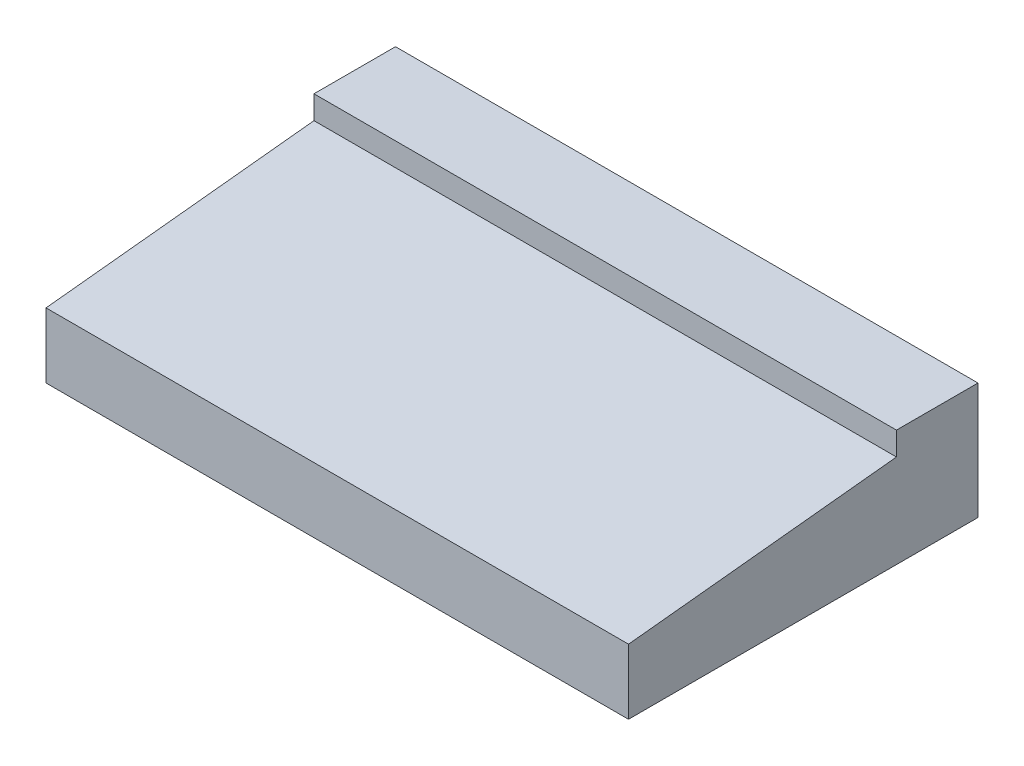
ISO-10303-21;
HEADER;
FILE_DESCRIPTION(('STEP AP214'),'2;1');
FILE_NAME('part.step','',(''),(''),'','','');
FILE_SCHEMA(('AUTOMOTIVE_DESIGN { 1 0 10303 214 1 1 1 1 }'));
ENDSEC;
DATA;
#1=APPLICATION_CONTEXT('core data for automotive mechanical design processes');
#2=APPLICATION_PROTOCOL_DEFINITION('international standard','automotive_design',2000,#1);
#3=PRODUCT_CONTEXT('',#1,'mechanical');
#4=PRODUCT('Part','Part','',(#3));
#5=PRODUCT_RELATED_PRODUCT_CATEGORY('part','',(#4));
#6=PRODUCT_DEFINITION_FORMATION('','',#4);
#7=PRODUCT_DEFINITION_CONTEXT('part definition',#1,'design');
#8=PRODUCT_DEFINITION('design','',#6,#7);
#9=PRODUCT_DEFINITION_SHAPE('','',#8);
#10=(LENGTH_UNIT() NAMED_UNIT(*) SI_UNIT(.MILLI.,.METRE.));
#11=(NAMED_UNIT(*) PLANE_ANGLE_UNIT() SI_UNIT($,.RADIAN.));
#12=(NAMED_UNIT(*) SI_UNIT($,.STERADIAN.) SOLID_ANGLE_UNIT());
#13=UNCERTAINTY_MEASURE_WITH_UNIT(LENGTH_MEASURE(1.E-05),#10,'distance_accuracy_value','');
#14=(GEOMETRIC_REPRESENTATION_CONTEXT(3) GLOBAL_UNCERTAINTY_ASSIGNED_CONTEXT((#13)) GLOBAL_UNIT_ASSIGNED_CONTEXT((#10,
#11,#12)) REPRESENTATION_CONTEXT('',''));
#15=CARTESIAN_POINT('',(0.,0.,0.));
#16=DIRECTION('',(0.,0.,1.));
#17=DIRECTION('',(1.,0.,0.));
#18=AXIS2_PLACEMENT_3D('',#15,#16,#17);
#19=CARTESIAN_POINT('',(50.,0.,-30.));
#20=DIRECTION('',(0.,1.,0.));
#21=DIRECTION('',(0.,0.,1.));
#22=AXIS2_PLACEMENT_3D('',#19,#20,#21);
#23=PLANE('',#22);
#24=DIRECTION('',(0.,0.,-1.));
#25=VECTOR('',#24,1.);
#26=CARTESIAN_POINT('',(0.,0.,-30.));
#27=LINE('',#26,#25);
#28=CARTESIAN_POINT('',(0.,0.,0.));
#29=VERTEX_POINT('',#28);
#30=CARTESIAN_POINT('',(0.,0.,-30.));
#31=VERTEX_POINT('',#30);
#32=EDGE_CURVE('E82',#29,#31,#27,.T.);
#33=ORIENTED_EDGE('',*,*,#32,.T.);
#34=DIRECTION('',(-1.,0.,0.));
#35=VECTOR('',#34,1.);
#36=CARTESIAN_POINT('',(50.,0.,-30.));
#37=LINE('',#36,#35);
#38=CARTESIAN_POINT('',(50.,0.,-30.));
#39=VERTEX_POINT('',#38);
#40=EDGE_CURVE('E11',#39,#31,#37,.T.);
#41=ORIENTED_EDGE('',*,*,#40,.F.);
#42=DIRECTION('',(0.,0.,-1.));
#43=VECTOR('',#42,1.);
#44=CARTESIAN_POINT('',(50.,0.,-30.));
#45=LINE('',#44,#43);
#46=CARTESIAN_POINT('',(50.,0.,0.));
#47=VERTEX_POINT('',#46);
#48=EDGE_CURVE('E105',#47,#39,#45,.T.);
#49=ORIENTED_EDGE('',*,*,#48,.F.);
#50=DIRECTION('',(-1.,0.,0.));
#51=VECTOR('',#50,1.);
#52=CARTESIAN_POINT('',(50.,0.,0.));
#53=LINE('',#52,#51);
#54=EDGE_CURVE('E95',#47,#29,#53,.T.);
#55=ORIENTED_EDGE('',*,*,#54,.T.);
#56=EDGE_LOOP('',(#33,#41,#49,#55));
#57=FACE_BOUND('',#56,.T.);
#58=ADVANCED_FACE('F26',(#57),#23,.F.);
#59=CARTESIAN_POINT('',(50.,10.,-30.));
#60=DIRECTION('',(0.,0.,1.));
#61=DIRECTION('',(1.,0.,0.));
#62=AXIS2_PLACEMENT_3D('',#59,#60,#61);
#63=PLANE('',#62);
#64=DIRECTION('',(0.,1.,0.));
#65=VECTOR('',#64,1.);
#66=CARTESIAN_POINT('',(0.,10.,-30.));
#67=LINE('',#66,#65);
#68=CARTESIAN_POINT('',(0.,10.,-30.));
#69=VERTEX_POINT('',#68);
#70=EDGE_CURVE('E78',#31,#69,#67,.T.);
#71=ORIENTED_EDGE('',*,*,#70,.T.);
#72=DIRECTION('',(-1.,0.,0.));
#73=VECTOR('',#72,1.);
#74=CARTESIAN_POINT('',(50.,10.,-30.));
#75=LINE('',#74,#73);
#76=CARTESIAN_POINT('',(50.,10.,-30.));
#77=VERTEX_POINT('',#76);
#78=EDGE_CURVE('E33',#77,#69,#75,.T.);
#79=ORIENTED_EDGE('',*,*,#78,.F.);
#80=DIRECTION('',(0.,1.,0.));
#81=VECTOR('',#80,1.);
#82=CARTESIAN_POINT('',(50.,10.,-30.));
#83=LINE('',#82,#81);
#84=EDGE_CURVE('E91',#39,#77,#83,.T.);
#85=ORIENTED_EDGE('',*,*,#84,.F.);
#86=ORIENTED_EDGE('',*,*,#40,.T.);
#87=EDGE_LOOP('',(#71,#79,#85,#86));
#88=FACE_BOUND('',#87,.T.);
#89=ADVANCED_FACE('F90',(#88),#63,.F.);
#90=CARTESIAN_POINT('',(50.,10.,-23.));
#91=DIRECTION('',(0.,-1.,0.));
#92=DIRECTION('',(0.,0.,-1.));
#93=AXIS2_PLACEMENT_3D('',#90,#91,#92);
#94=PLANE('',#93);
#95=DIRECTION('',(0.,0.,1.));
#96=VECTOR('',#95,1.);
#97=CARTESIAN_POINT('',(0.,10.,-23.));
#98=LINE('',#97,#96);
#99=CARTESIAN_POINT('',(0.,10.,-23.));
#100=VERTEX_POINT('',#99);
#101=EDGE_CURVE('E84',#69,#100,#98,.T.);
#102=ORIENTED_EDGE('',*,*,#101,.T.);
#103=DIRECTION('',(-1.,0.,0.));
#104=VECTOR('',#103,1.);
#105=CARTESIAN_POINT('',(50.,10.,-23.));
#106=LINE('',#105,#104);
#107=CARTESIAN_POINT('',(50.,10.,-23.));
#108=VERTEX_POINT('',#107);
#109=EDGE_CURVE('E121',#108,#100,#106,.T.);
#110=ORIENTED_EDGE('',*,*,#109,.F.);
#111=DIRECTION('',(0.,0.,1.));
#112=VECTOR('',#111,1.);
#113=CARTESIAN_POINT('',(50.,10.,-23.));
#114=LINE('',#113,#112);
#115=EDGE_CURVE('E108',#77,#108,#114,.T.);
#116=ORIENTED_EDGE('',*,*,#115,.F.);
#117=ORIENTED_EDGE('',*,*,#78,.T.);
#118=EDGE_LOOP('',(#102,#110,#116,#117));
#119=FACE_BOUND('',#118,.T.);
#120=ADVANCED_FACE('F125',(#119),#94,.F.);
#121=CARTESIAN_POINT('',(50.,8.,-23.));
#122=DIRECTION('',(0.,0.,-1.));
#123=DIRECTION('',(-1.,0.,0.));
#124=AXIS2_PLACEMENT_3D('',#121,#122,#123);
#125=PLANE('',#124);
#126=DIRECTION('',(0.,-1.,0.));
#127=VECTOR('',#126,1.);
#128=CARTESIAN_POINT('',(0.,8.,-23.));
#129=LINE('',#128,#127);
#130=CARTESIAN_POINT('',(0.,8.,-23.));
#131=VERTEX_POINT('',#130);
#132=EDGE_CURVE('E99',#100,#131,#129,.T.);
#133=ORIENTED_EDGE('',*,*,#132,.T.);
#134=DIRECTION('',(-1.,0.,0.));
#135=VECTOR('',#134,1.);
#136=CARTESIAN_POINT('',(50.,8.,-23.));
#137=LINE('',#136,#135);
#138=CARTESIAN_POINT('',(50.,8.,-23.));
#139=VERTEX_POINT('',#138);
#140=EDGE_CURVE('E118',#139,#131,#137,.T.);
#141=ORIENTED_EDGE('',*,*,#140,.F.);
#142=DIRECTION('',(0.,-1.,0.));
#143=VECTOR('',#142,1.);
#144=CARTESIAN_POINT('',(50.,8.,-23.));
#145=LINE('',#144,#143);
#146=EDGE_CURVE('E110',#108,#139,#145,.T.);
#147=ORIENTED_EDGE('',*,*,#146,.F.);
#148=ORIENTED_EDGE('',*,*,#109,.T.);
#149=EDGE_LOOP('',(#133,#141,#147,#148));
#150=FACE_BOUND('',#149,.T.);
#151=ADVANCED_FACE('F131',(#150),#125,.F.);
#152=CARTESIAN_POINT('',(50.,8.,-23.));
#153=DIRECTION('',(0.,-0.994521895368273,-0.104528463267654));
#154=DIRECTION('',(0.,0.104528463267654,-0.994521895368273));
#155=AXIS2_PLACEMENT_3D('',#152,#153,#154);
#156=PLANE('',#155);
#157=DIRECTION('',(0.,-0.104528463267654,0.994521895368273));
#158=VECTOR('',#157,1.);
#159=CARTESIAN_POINT('',(0.,8.,-23.));
#160=LINE('',#159,#158);
#161=CARTESIAN_POINT('',(0.,5.58290395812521,-0.00286733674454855));
#162=VERTEX_POINT('',#161);
#163=EDGE_CURVE('E101',#131,#162,#160,.T.);
#164=ORIENTED_EDGE('',*,*,#163,.T.);
#165=DIRECTION('',(-1.,0.,0.));
#166=VECTOR('',#165,1.);
#167=CARTESIAN_POINT('',(50.,5.58290395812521,-0.00286733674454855));
#168=LINE('',#167,#166);
#169=CARTESIAN_POINT('',(50.,5.58290395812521,-0.00286733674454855));
#170=VERTEX_POINT('',#169);
#171=EDGE_CURVE('E115',#170,#162,#168,.T.);
#172=ORIENTED_EDGE('',*,*,#171,.F.);
#173=DIRECTION('',(0.,-0.104528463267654,0.994521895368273));
#174=VECTOR('',#173,1.);
#175=CARTESIAN_POINT('',(50.,8.,-23.));
#176=LINE('',#175,#174);
#177=EDGE_CURVE('E45',#139,#170,#176,.T.);
#178=ORIENTED_EDGE('',*,*,#177,.F.);
#179=ORIENTED_EDGE('',*,*,#140,.T.);
#180=EDGE_LOOP('',(#164,#172,#178,#179));
#181=FACE_BOUND('',#180,.T.);
#182=ADVANCED_FACE('F134',(#181),#156,.F.);
#183=CARTESIAN_POINT('',(50.,0.,0.));
#184=DIRECTION('',(0.,-0.000513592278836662,-0.999999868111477));
#185=DIRECTION('',(0.,0.999999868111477,-0.000513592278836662));
#186=AXIS2_PLACEMENT_3D('',#183,#184,#185);
#187=PLANE('',#186);
#188=DIRECTION('',(0.,-0.999999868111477,0.000513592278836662));
#189=VECTOR('',#188,1.);
#190=CARTESIAN_POINT('',(0.,0.,0.));
#191=LINE('',#190,#189);
#192=EDGE_CURVE('E103',#162,#29,#191,.T.);
#193=ORIENTED_EDGE('',*,*,#192,.T.);
#194=ORIENTED_EDGE('',*,*,#54,.F.);
#195=DIRECTION('',(0.,-0.999999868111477,0.000513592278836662));
#196=VECTOR('',#195,1.);
#197=CARTESIAN_POINT('',(50.,0.,0.));
#198=LINE('',#197,#196);
#199=EDGE_CURVE('E40',#170,#47,#198,.T.);
#200=ORIENTED_EDGE('',*,*,#199,.F.);
#201=ORIENTED_EDGE('',*,*,#171,.T.);
#202=EDGE_LOOP('',(#193,#194,#200,#201));
#203=FACE_BOUND('',#202,.T.);
#204=ADVANCED_FACE('F136',(#203),#187,.F.);
#205=CARTESIAN_POINT('',(50.,0.,-23.));
#206=DIRECTION('',(-1.,0.,0.));
#207=DIRECTION('',(0.,0.,1.));
#208=AXIS2_PLACEMENT_3D('',#205,#206,#207);
#209=PLANE('',#208);
#210=ORIENTED_EDGE('',*,*,#48,.T.);
#211=ORIENTED_EDGE('',*,*,#84,.T.);
#212=ORIENTED_EDGE('',*,*,#115,.T.);
#213=ORIENTED_EDGE('',*,*,#146,.T.);
#214=ORIENTED_EDGE('',*,*,#177,.T.);
#215=ORIENTED_EDGE('',*,*,#199,.T.);
#216=EDGE_LOOP('',(#210,#211,#212,#213,#214,#215));
#217=FACE_BOUND('',#216,.T.);
#218=ADVANCED_FACE('F128',(#217),#209,.F.);
#219=CARTESIAN_POINT('',(0.,0.,-23.));
#220=DIRECTION('',(-1.,0.,0.));
#221=DIRECTION('',(0.,0.,1.));
#222=AXIS2_PLACEMENT_3D('',#219,#220,#221);
#223=PLANE('',#222);
#224=ORIENTED_EDGE('',*,*,#32,.F.);
#225=ORIENTED_EDGE('',*,*,#192,.F.);
#226=ORIENTED_EDGE('',*,*,#163,.F.);
#227=ORIENTED_EDGE('',*,*,#132,.F.);
#228=ORIENTED_EDGE('',*,*,#101,.F.);
#229=ORIENTED_EDGE('',*,*,#70,.F.);
#230=EDGE_LOOP('',(#224,#225,#226,#227,#228,#229));
#231=FACE_BOUND('',#230,.T.);
#232=ADVANCED_FACE('F79',(#231),#223,.T.);
#233=CLOSED_SHELL('',(#58,#89,#120,#151,#182,#204,#218,#232));
#234=MANIFOLD_SOLID_BREP('B2',#233);
#235=ADVANCED_BREP_SHAPE_REPRESENTATION('',(#18,#234),#14);
#236=SHAPE_DEFINITION_REPRESENTATION(#9,#235);
ENDSEC;
END-ISO-10303-21;
